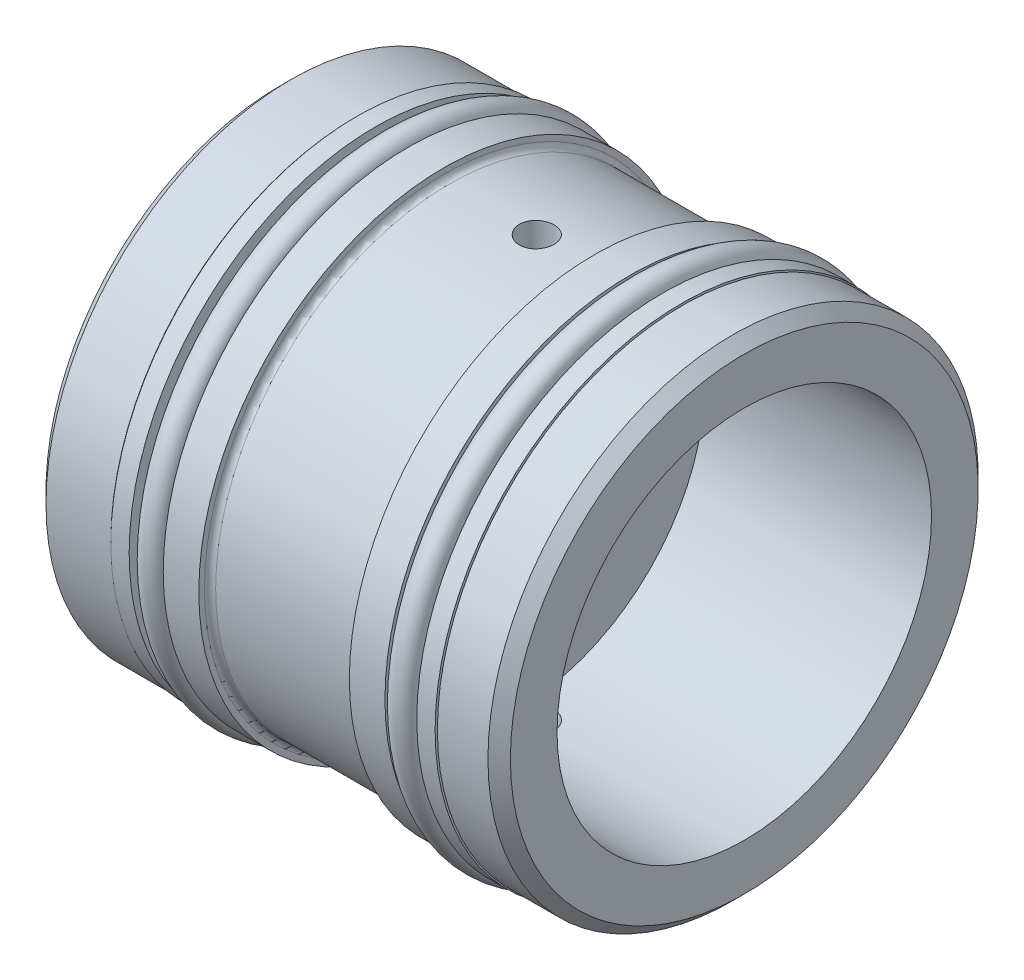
from build123d import *

# Parameters (mm, degrees)
FILLET1_R               = 0.381
CHAMFER1_SIZE           = 0.762
SKETCH6_R               = 0.889
SKETCH6_W               = 1.2446
SKETCH6_H               = 1.3462
CUT_EXTRUDE1_DEPTH      = 29.806606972
CUT_EXTRUDE1_DEPTH_BACK = 29.806606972
SKETCH7_R               = 1.1811


with BuildPart() as part:
    # Sketch1 → Revolve1 (revolve)
    with BuildSketch(Plane.XY, mode=Mode.PRIVATE) as revolve1_sk:
        Polygon((-15.748, 6.35), (-15.748, 16.6243), (-10.5918, 16.6243), (-10.5918, 15.3543), (-7.0358, 15.3543), (-7.0358, 16.6243), (-4.6228, 16.6243), (-4.6228, 15.8623), (5.588, 15.8623), (5.588, 16.6243), (8.001, 16.6243), (8.001, 15.3543), (11.557, 15.3543), (11.557, 16.6243), (15.748, 16.6243), (15.748, 12.7), (0.3556, 12.7), (0.3556, 6.35), align=None)
    revolve(revolve1_sk.sketch.rotate(Axis((0, 0, 0), (1, 0, 0)), 90), axis=Axis((0, 0, 0), (1, 0, 0)))

    # Fillet1
    fillet1_edges = [part.edges().sort_by_distance(p)[0] for p in [
        (-4.6228, 0, -15.8623),
        (5.588, 0, -15.8623),
    ]]
    fillet(fillet1_edges, radius=FILLET1_R)

    # Chamfer1
    chamfer1_edges = [part.edges().sort_by_distance(p)[0] for p in [
        (-15.748, 0, -16.6243),
        (15.748, 0, -16.6243),
    ]]
    chamfer(chamfer1_edges, length=CHAMFER1_SIZE)

    # Sketch6 → Revolve3 (revolve)
    with BuildSketch(Plane.XY, mode=Mode.PRIVATE) as revolve3_sk:
        with Locations((-8.001, 16.1671)):
            Circle(SKETCH6_R)
        with Locations((8.9662, 16.1671)):
            Circle(SKETCH6_R)
        with Locations((-9.8933, 16.0274)):
            Rectangle(SKETCH6_W, SKETCH6_H)
        with Locations((10.8585, 16.0274)):
            Rectangle(SKETCH6_W, SKETCH6_H)
    revolve(revolve3_sk.sketch.rotate(Axis((0, 0, 0), (1, 0, 0)), 90), axis=Axis((0, 0, 0), (1, 0, 0)))

    # Sketch7 → Cut-Extrude1 (cut, two sides: drawn at the far end of the back side and taken through both)
    with BuildSketch(Plane(origin=(0, 0, 0), x_dir=(0, 0, -1), z_dir=(0, 1, 0)).offset(-CUT_EXTRUDE1_DEPTH_BACK)):
        with Locations(Location((0, -1.6764, 0), (0, 0, 180))):
            Circle(SKETCH7_R)
    extrude(amount=CUT_EXTRUDE1_DEPTH + CUT_EXTRUDE1_DEPTH_BACK, mode=Mode.SUBTRACT)


solid = part.part
